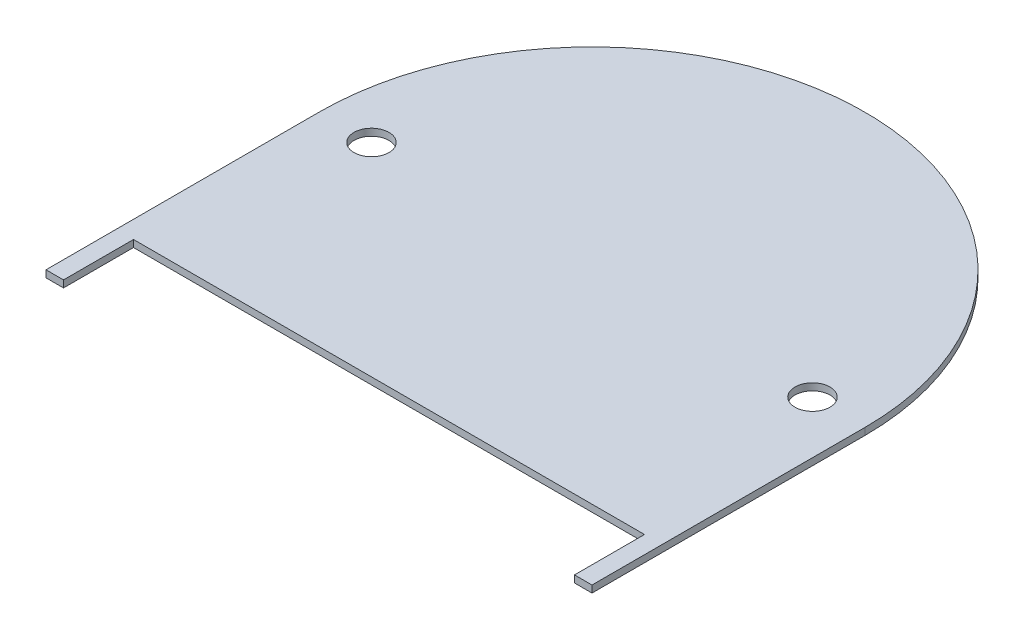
ISO-10303-21;
HEADER;
FILE_DESCRIPTION(('STEP AP214'),'2;1');
FILE_NAME('part.step','',(''),(''),'','','');
FILE_SCHEMA(('AUTOMOTIVE_DESIGN { 1 0 10303 214 1 1 1 1 }'));
ENDSEC;
DATA;
#1=APPLICATION_CONTEXT('core data for automotive mechanical design processes');
#2=APPLICATION_PROTOCOL_DEFINITION('international standard','automotive_design',2000,#1);
#3=PRODUCT_CONTEXT('',#1,'mechanical');
#4=PRODUCT('Part','Part','',(#3));
#5=PRODUCT_RELATED_PRODUCT_CATEGORY('part','',(#4));
#6=PRODUCT_DEFINITION_FORMATION('','',#4);
#7=PRODUCT_DEFINITION_CONTEXT('part definition',#1,'design');
#8=PRODUCT_DEFINITION('design','',#6,#7);
#9=PRODUCT_DEFINITION_SHAPE('','',#8);
#10=(LENGTH_UNIT() NAMED_UNIT(*) SI_UNIT(.MILLI.,.METRE.));
#11=(NAMED_UNIT(*) PLANE_ANGLE_UNIT() SI_UNIT($,.RADIAN.));
#12=(NAMED_UNIT(*) SI_UNIT($,.STERADIAN.) SOLID_ANGLE_UNIT());
#13=UNCERTAINTY_MEASURE_WITH_UNIT(LENGTH_MEASURE(1.E-05),#10,'distance_accuracy_value','');
#14=(GEOMETRIC_REPRESENTATION_CONTEXT(3) GLOBAL_UNCERTAINTY_ASSIGNED_CONTEXT((#13)) GLOBAL_UNIT_ASSIGNED_CONTEXT((#10,
#11,#12)) REPRESENTATION_CONTEXT('',''));
#15=CARTESIAN_POINT('',(0.,0.,0.));
#16=DIRECTION('',(0.,0.,1.));
#17=DIRECTION('',(1.,0.,0.));
#18=AXIS2_PLACEMENT_3D('',#15,#16,#17);
#19=CARTESIAN_POINT('',(0.,2.54,99.06));
#20=DIRECTION('',(0.,0.,-1.));
#21=DIRECTION('',(-1.,0.,0.));
#22=AXIS2_PLACEMENT_3D('',#19,#20,#21);
#23=PLANE('',#22);
#24=DIRECTION('',(1.,0.,0.));
#25=VECTOR('',#24,1.);
#26=CARTESIAN_POINT('',(0.,0.,99.06));
#27=LINE('',#26,#25);
#28=CARTESIAN_POINT('',(-99.06,0.,99.06));
#29=VERTEX_POINT('',#28);
#30=CARTESIAN_POINT('',(-92.71,0.,99.06));
#31=VERTEX_POINT('',#30);
#32=EDGE_CURVE('E136',#29,#31,#27,.T.);
#33=ORIENTED_EDGE('',*,*,#32,.T.);
#34=DIRECTION('',(0.,1.,0.));
#35=VECTOR('',#34,1.);
#36=CARTESIAN_POINT('',(-92.71,0.,99.06));
#37=LINE('',#36,#35);
#38=CARTESIAN_POINT('',(-92.71,2.54,99.06));
#39=VERTEX_POINT('',#38);
#40=EDGE_CURVE('E120',#31,#39,#37,.T.);
#41=ORIENTED_EDGE('',*,*,#40,.T.);
#42=DIRECTION('',(1.,0.,0.));
#43=VECTOR('',#42,1.);
#44=CARTESIAN_POINT('',(0.,2.54,99.06));
#45=LINE('',#44,#43);
#46=CARTESIAN_POINT('',(-99.06,2.54,99.06));
#47=VERTEX_POINT('',#46);
#48=EDGE_CURVE('E165',#47,#39,#45,.T.);
#49=ORIENTED_EDGE('',*,*,#48,.F.);
#50=DIRECTION('',(0.,-1.,0.));
#51=VECTOR('',#50,1.);
#52=CARTESIAN_POINT('',(-99.06,2.54,99.06));
#53=LINE('',#52,#51);
#54=EDGE_CURVE('E55',#47,#29,#53,.T.);
#55=ORIENTED_EDGE('',*,*,#54,.T.);
#56=EDGE_LOOP('',(#33,#41,#49,#55));
#57=FACE_BOUND('',#56,.T.);
#58=ADVANCED_FACE('F46',(#57),#23,.F.);
#59=CARTESIAN_POINT('',(0.,2.54,0.));
#60=DIRECTION('',(0.,-1.,0.));
#61=DIRECTION('',(0.,0.,-1.));
#62=AXIS2_PLACEMENT_3D('',#59,#60,#61);
#63=CYLINDRICAL_SURFACE('',#62,99.06);
#64=CARTESIAN_POINT('',(0.,0.,0.));
#65=DIRECTION('',(0.,1.,0.));
#66=DIRECTION('',(0.,0.,1.));
#67=AXIS2_PLACEMENT_3D('',#64,#65,#66);
#68=CIRCLE('',#67,99.06);
#69=CARTESIAN_POINT('',(99.06,0.,0.));
#70=VERTEX_POINT('',#69);
#71=CARTESIAN_POINT('',(-99.06,0.,0.));
#72=VERTEX_POINT('',#71);
#73=EDGE_CURVE('E180',#70,#72,#68,.T.);
#74=ORIENTED_EDGE('',*,*,#73,.T.);
#75=DIRECTION('',(0.,-1.,0.));
#76=VECTOR('',#75,1.);
#77=CARTESIAN_POINT('',(-99.06,2.54,0.));
#78=LINE('',#77,#76);
#79=CARTESIAN_POINT('',(-99.06,2.54,0.));
#80=VERTEX_POINT('',#79);
#81=EDGE_CURVE('E11',#80,#72,#78,.T.);
#82=ORIENTED_EDGE('',*,*,#81,.F.);
#83=CARTESIAN_POINT('',(0.,2.54,0.));
#84=DIRECTION('',(0.,1.,0.));
#85=DIRECTION('',(0.,0.,1.));
#86=AXIS2_PLACEMENT_3D('',#83,#84,#85);
#87=CIRCLE('',#86,99.06);
#88=CARTESIAN_POINT('',(99.06,2.54,0.));
#89=VERTEX_POINT('',#88);
#90=EDGE_CURVE('E150',#89,#80,#87,.T.);
#91=ORIENTED_EDGE('',*,*,#90,.F.);
#92=DIRECTION('',(0.,-1.,0.));
#93=VECTOR('',#92,1.);
#94=CARTESIAN_POINT('',(99.06,2.54,0.));
#95=LINE('',#94,#93);
#96=EDGE_CURVE('E71',#89,#70,#95,.T.);
#97=ORIENTED_EDGE('',*,*,#96,.T.);
#98=EDGE_LOOP('',(#74,#82,#91,#97));
#99=FACE_BOUND('',#98,.T.);
#100=ADVANCED_FACE('F48',(#99),#63,.T.);
#101=CARTESIAN_POINT('',(-99.06,2.54,0.));
#102=DIRECTION('',(1.,0.,0.));
#103=DIRECTION('',(0.,0.,-1.));
#104=AXIS2_PLACEMENT_3D('',#101,#102,#103);
#105=PLANE('',#104);
#106=DIRECTION('',(0.,0.,1.));
#107=VECTOR('',#106,1.);
#108=CARTESIAN_POINT('',(-99.06,0.,0.));
#109=LINE('',#108,#107);
#110=EDGE_CURVE('E152',#72,#29,#109,.T.);
#111=ORIENTED_EDGE('',*,*,#110,.T.);
#112=ORIENTED_EDGE('',*,*,#54,.F.);
#113=DIRECTION('',(0.,0.,1.));
#114=VECTOR('',#113,1.);
#115=CARTESIAN_POINT('',(-99.06,2.54,0.));
#116=LINE('',#115,#114);
#117=EDGE_CURVE('E97',#80,#47,#116,.T.);
#118=ORIENTED_EDGE('',*,*,#117,.F.);
#119=ORIENTED_EDGE('',*,*,#81,.T.);
#120=EDGE_LOOP('',(#111,#112,#118,#119));
#121=FACE_BOUND('',#120,.T.);
#122=ADVANCED_FACE('F235',(#121),#105,.F.);
#123=CARTESIAN_POINT('',(92.71,2.54,99.06));
#124=VERTEX_POINT('',#123);
#125=CARTESIAN_POINT('',(99.06,2.54,99.06));
#126=VERTEX_POINT('',#125);
#127=EDGE_CURVE('E168',#124,#126,#45,.T.);
#128=ORIENTED_EDGE('',*,*,#127,.F.);
#129=DIRECTION('',(0.,1.,0.));
#130=VECTOR('',#129,1.);
#131=CARTESIAN_POINT('',(92.71,0.,99.06));
#132=LINE('',#131,#130);
#133=CARTESIAN_POINT('',(92.71,0.,99.06));
#134=VERTEX_POINT('',#133);
#135=EDGE_CURVE('E131',#134,#124,#132,.T.);
#136=ORIENTED_EDGE('',*,*,#135,.F.);
#137=CARTESIAN_POINT('',(99.06,0.,99.06));
#138=VERTEX_POINT('',#137);
#139=EDGE_CURVE('E145',#134,#138,#27,.T.);
#140=ORIENTED_EDGE('',*,*,#139,.T.);
#141=DIRECTION('',(0.,-1.,0.));
#142=VECTOR('',#141,1.);
#143=CARTESIAN_POINT('',(99.06,2.54,99.06));
#144=LINE('',#143,#142);
#145=EDGE_CURVE('E158',#126,#138,#144,.T.);
#146=ORIENTED_EDGE('',*,*,#145,.F.);
#147=EDGE_LOOP('',(#128,#136,#140,#146));
#148=FACE_BOUND('',#147,.T.);
#149=ADVANCED_FACE('F229',(#148),#23,.F.);
#150=CARTESIAN_POINT('',(99.06,2.54,0.));
#151=DIRECTION('',(1.,0.,0.));
#152=DIRECTION('',(0.,0.,-1.));
#153=AXIS2_PLACEMENT_3D('',#150,#151,#152);
#154=PLANE('',#153);
#155=DIRECTION('',(0.,0.,1.));
#156=VECTOR('',#155,1.);
#157=CARTESIAN_POINT('',(99.06,0.,0.));
#158=LINE('',#157,#156);
#159=EDGE_CURVE('E144',#70,#138,#158,.T.);
#160=ORIENTED_EDGE('',*,*,#159,.F.);
#161=ORIENTED_EDGE('',*,*,#96,.F.);
#162=DIRECTION('',(0.,0.,1.));
#163=VECTOR('',#162,1.);
#164=CARTESIAN_POINT('',(99.06,2.54,0.));
#165=LINE('',#164,#163);
#166=EDGE_CURVE('E159',#89,#126,#165,.T.);
#167=ORIENTED_EDGE('',*,*,#166,.T.);
#168=ORIENTED_EDGE('',*,*,#145,.T.);
#169=EDGE_LOOP('',(#160,#161,#167,#168));
#170=FACE_BOUND('',#169,.T.);
#171=ADVANCED_FACE('F237',(#170),#154,.T.);
#172=CARTESIAN_POINT('',(0.,2.54,0.));
#173=DIRECTION('',(0.,1.,0.));
#174=DIRECTION('',(0.,0.,1.));
#175=AXIS2_PLACEMENT_3D('',#172,#173,#174);
#176=PLANE('',#175);
#177=DIRECTION('',(0.,0.,1.));
#178=VECTOR('',#177,1.);
#179=CARTESIAN_POINT('',(-92.71,2.54,73.66));
#180=LINE('',#179,#178);
#181=CARTESIAN_POINT('',(-92.71,2.54,73.66));
#182=VERTEX_POINT('',#181);
#183=EDGE_CURVE('E125',#182,#39,#180,.T.);
#184=ORIENTED_EDGE('',*,*,#183,.F.);
#185=DIRECTION('',(-1.,0.,0.));
#186=VECTOR('',#185,1.);
#187=CARTESIAN_POINT('',(92.71,2.54,73.66));
#188=LINE('',#187,#186);
#189=CARTESIAN_POINT('',(92.71,2.54,73.66));
#190=VERTEX_POINT('',#189);
#191=EDGE_CURVE('E140',#190,#182,#188,.T.);
#192=ORIENTED_EDGE('',*,*,#191,.F.);
#193=DIRECTION('',(0.,0.,-1.));
#194=VECTOR('',#193,1.);
#195=CARTESIAN_POINT('',(92.71,2.54,73.66));
#196=LINE('',#195,#194);
#197=EDGE_CURVE('E252',#124,#190,#196,.T.);
#198=ORIENTED_EDGE('',*,*,#197,.F.);
#199=ORIENTED_EDGE('',*,*,#127,.T.);
#200=ORIENTED_EDGE('',*,*,#166,.F.);
#201=ORIENTED_EDGE('',*,*,#90,.T.);
#202=ORIENTED_EDGE('',*,*,#117,.T.);
#203=ORIENTED_EDGE('',*,*,#48,.T.);
#204=EDGE_LOOP('',(#184,#192,#198,#199,#200,#201,#202,#203));
#205=FACE_BOUND('',#204,.T.);
#206=CARTESIAN_POINT('',(-80.01,2.54,0.));
#207=DIRECTION('',(0.,1.,0.));
#208=DIRECTION('',(0.,0.,1.));
#209=AXIS2_PLACEMENT_3D('',#206,#207,#208);
#210=CIRCLE('',#209,6.35);
#211=CARTESIAN_POINT('',(-80.01,2.54,6.35));
#212=VERTEX_POINT('',#211);
#213=EDGE_CURVE('E195',#212,#212,#210,.T.);
#214=ORIENTED_EDGE('',*,*,#213,.F.);
#215=EDGE_LOOP('',(#214));
#216=FACE_BOUND('',#215,.T.);
#217=CARTESIAN_POINT('',(80.01,2.54,0.));
#218=DIRECTION('',(0.,1.,0.));
#219=DIRECTION('',(0.,0.,-1.));
#220=AXIS2_PLACEMENT_3D('',#217,#218,#219);
#221=CIRCLE('',#220,6.35);
#222=CARTESIAN_POINT('',(80.01,2.54,-6.35));
#223=VERTEX_POINT('',#222);
#224=EDGE_CURVE('E202',#223,#223,#221,.T.);
#225=ORIENTED_EDGE('',*,*,#224,.F.);
#226=EDGE_LOOP('',(#225));
#227=FACE_BOUND('',#226,.T.);
#228=ADVANCED_FACE('F223',(#205,#216,#227),#176,.T.);
#229=CARTESIAN_POINT('',(0.,0.,0.));
#230=DIRECTION('',(0.,1.,0.));
#231=DIRECTION('',(0.,0.,1.));
#232=AXIS2_PLACEMENT_3D('',#229,#230,#231);
#233=PLANE('',#232);
#234=CARTESIAN_POINT('',(-80.01,0.,0.));
#235=DIRECTION('',(0.,1.,0.));
#236=DIRECTION('',(0.,0.,1.));
#237=AXIS2_PLACEMENT_3D('',#234,#235,#236);
#238=CIRCLE('',#237,6.35);
#239=CARTESIAN_POINT('',(-80.01,0.,6.35));
#240=VERTEX_POINT('',#239);
#241=EDGE_CURVE('E199',#240,#240,#238,.T.);
#242=ORIENTED_EDGE('',*,*,#241,.T.);
#243=EDGE_LOOP('',(#242));
#244=FACE_BOUND('',#243,.T.);
#245=CARTESIAN_POINT('',(80.01,0.,0.));
#246=DIRECTION('',(0.,1.,0.));
#247=DIRECTION('',(0.,0.,-1.));
#248=AXIS2_PLACEMENT_3D('',#245,#246,#247);
#249=CIRCLE('',#248,6.35);
#250=CARTESIAN_POINT('',(80.01,0.,-6.35));
#251=VERTEX_POINT('',#250);
#252=EDGE_CURVE('E178',#251,#251,#249,.T.);
#253=ORIENTED_EDGE('',*,*,#252,.T.);
#254=EDGE_LOOP('',(#253));
#255=FACE_BOUND('',#254,.T.);
#256=DIRECTION('',(-1.,0.,0.));
#257=VECTOR('',#256,1.);
#258=CARTESIAN_POINT('',(92.71,0.,73.66));
#259=LINE('',#258,#257);
#260=CARTESIAN_POINT('',(92.71,0.,73.66));
#261=VERTEX_POINT('',#260);
#262=CARTESIAN_POINT('',(-92.71,0.,73.66));
#263=VERTEX_POINT('',#262);
#264=EDGE_CURVE('E62',#261,#263,#259,.T.);
#265=ORIENTED_EDGE('',*,*,#264,.T.);
#266=DIRECTION('',(0.,0.,1.));
#267=VECTOR('',#266,1.);
#268=CARTESIAN_POINT('',(-92.71,0.,73.66));
#269=LINE('',#268,#267);
#270=EDGE_CURVE('E123',#263,#31,#269,.T.);
#271=ORIENTED_EDGE('',*,*,#270,.T.);
#272=ORIENTED_EDGE('',*,*,#32,.F.);
#273=ORIENTED_EDGE('',*,*,#110,.F.);
#274=ORIENTED_EDGE('',*,*,#73,.F.);
#275=ORIENTED_EDGE('',*,*,#159,.T.);
#276=ORIENTED_EDGE('',*,*,#139,.F.);
#277=DIRECTION('',(0.,0.,-1.));
#278=VECTOR('',#277,1.);
#279=CARTESIAN_POINT('',(92.71,0.,73.66));
#280=LINE('',#279,#278);
#281=EDGE_CURVE('E139',#134,#261,#280,.T.);
#282=ORIENTED_EDGE('',*,*,#281,.T.);
#283=EDGE_LOOP('',(#265,#271,#272,#273,#274,#275,#276,#282));
#284=FACE_BOUND('',#283,.T.);
#285=ADVANCED_FACE('F135',(#244,#255,#284),#233,.F.);
#286=CARTESIAN_POINT('',(80.01,0.,0.));
#287=DIRECTION('',(0.,1.,0.));
#288=DIRECTION('',(0.,0.,1.));
#289=AXIS2_PLACEMENT_3D('',#286,#287,#288);
#290=CYLINDRICAL_SURFACE('',#289,6.35);
#291=ORIENTED_EDGE('',*,*,#252,.F.);
#292=EDGE_LOOP('',(#291));
#293=FACE_BOUND('',#292,.T.);
#294=ORIENTED_EDGE('',*,*,#224,.T.);
#295=EDGE_LOOP('',(#294));
#296=FACE_BOUND('',#295,.T.);
#297=ADVANCED_FACE('F212',(#293,#296),#290,.F.);
#298=CARTESIAN_POINT('',(-80.01,0.,0.));
#299=DIRECTION('',(0.,1.,0.));
#300=DIRECTION('',(0.,0.,1.));
#301=AXIS2_PLACEMENT_3D('',#298,#299,#300);
#302=CYLINDRICAL_SURFACE('',#301,6.35);
#303=ORIENTED_EDGE('',*,*,#241,.F.);
#304=EDGE_LOOP('',(#303));
#305=FACE_BOUND('',#304,.T.);
#306=ORIENTED_EDGE('',*,*,#213,.T.);
#307=EDGE_LOOP('',(#306));
#308=FACE_BOUND('',#307,.T.);
#309=ADVANCED_FACE('F214',(#305,#308),#302,.F.);
#310=CARTESIAN_POINT('',(-92.71,0.,73.66));
#311=DIRECTION('',(-1.,0.,0.));
#312=DIRECTION('',(0.,0.,1.));
#313=AXIS2_PLACEMENT_3D('',#310,#311,#312);
#314=PLANE('',#313);
#315=ORIENTED_EDGE('',*,*,#183,.T.);
#316=ORIENTED_EDGE('',*,*,#40,.F.);
#317=ORIENTED_EDGE('',*,*,#270,.F.);
#318=DIRECTION('',(0.,1.,0.));
#319=VECTOR('',#318,1.);
#320=CARTESIAN_POINT('',(-92.71,0.,73.66));
#321=LINE('',#320,#319);
#322=EDGE_CURVE('E182',#263,#182,#321,.T.);
#323=ORIENTED_EDGE('',*,*,#322,.T.);
#324=EDGE_LOOP('',(#315,#316,#317,#323));
#325=FACE_BOUND('',#324,.T.);
#326=ADVANCED_FACE('F122',(#325),#314,.F.);
#327=CARTESIAN_POINT('',(92.71,0.,73.66));
#328=DIRECTION('',(0.,0.,-1.));
#329=DIRECTION('',(-1.,0.,0.));
#330=AXIS2_PLACEMENT_3D('',#327,#328,#329);
#331=PLANE('',#330);
#332=ORIENTED_EDGE('',*,*,#191,.T.);
#333=ORIENTED_EDGE('',*,*,#322,.F.);
#334=ORIENTED_EDGE('',*,*,#264,.F.);
#335=DIRECTION('',(0.,1.,0.));
#336=VECTOR('',#335,1.);
#337=CARTESIAN_POINT('',(92.71,0.,73.66));
#338=LINE('',#337,#336);
#339=EDGE_CURVE('E185',#261,#190,#338,.T.);
#340=ORIENTED_EDGE('',*,*,#339,.T.);
#341=EDGE_LOOP('',(#332,#333,#334,#340));
#342=FACE_BOUND('',#341,.T.);
#343=ADVANCED_FACE('F263',(#342),#331,.F.);
#344=CARTESIAN_POINT('',(92.71,0.,73.66));
#345=DIRECTION('',(1.,0.,0.));
#346=DIRECTION('',(0.,0.,-1.));
#347=AXIS2_PLACEMENT_3D('',#344,#345,#346);
#348=PLANE('',#347);
#349=ORIENTED_EDGE('',*,*,#197,.T.);
#350=ORIENTED_EDGE('',*,*,#339,.F.);
#351=ORIENTED_EDGE('',*,*,#281,.F.);
#352=ORIENTED_EDGE('',*,*,#135,.T.);
#353=EDGE_LOOP('',(#349,#350,#351,#352));
#354=FACE_BOUND('',#353,.T.);
#355=ADVANCED_FACE('F262',(#354),#348,.F.);
#356=CLOSED_SHELL('',(#58,#100,#122,#149,#171,#228,#285,#297,#309,#326,#343,#355));
#357=MANIFOLD_SOLID_BREP('B2',#356);
#358=ADVANCED_BREP_SHAPE_REPRESENTATION('',(#18,#357),#14);
#359=SHAPE_DEFINITION_REPRESENTATION(#9,#358);
ENDSEC;
END-ISO-10303-21;
